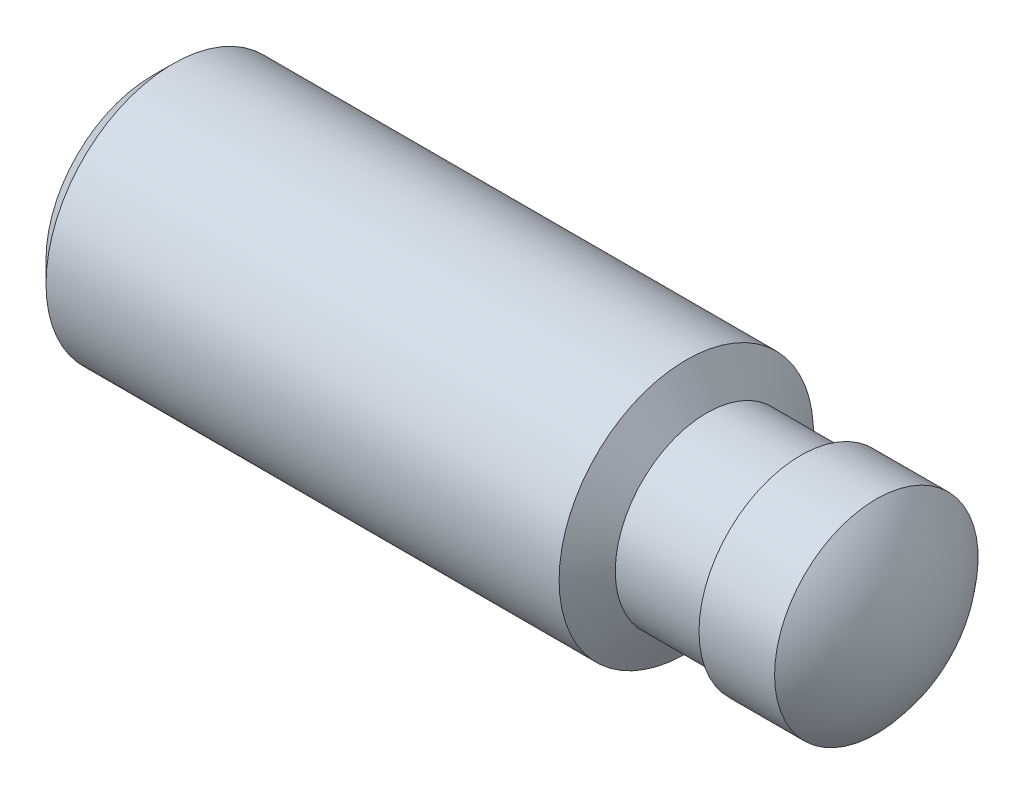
from build123d import *


with BuildPart() as part:
    # BodySke → BaseBody (revolve)
    with BuildSketch(Plane.XY, mode=Mode.PRIVATE) as basebody_sk:
        with BuildLine():
            Line((21.808290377, 3.6), (25.5, 3.6))
            Line((25.5, 3.6), (25.5, 4))
            Line((25.5, 4), (28.472135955, 4))
            ThreePointArc((28.472135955, 4), (29.605034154, 2.140932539), (30, 0))
            Line((30, 0), (0, 0))
            Line((0, 0), (0, 4.172))
            Line((0, 4.172), (0.828, 5))
            Line((0.828, 5), (21, 5))
            Line((21, 5), (21.808290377, 3.6))
        make_face()
    revolve(basebody_sk.sketch.rotate(Axis((-3.175, 0, 0), (1, 0, 0)), 90), axis=Axis((-3.175, 0, 0), (1, 0, 0)))


solid = part.part
